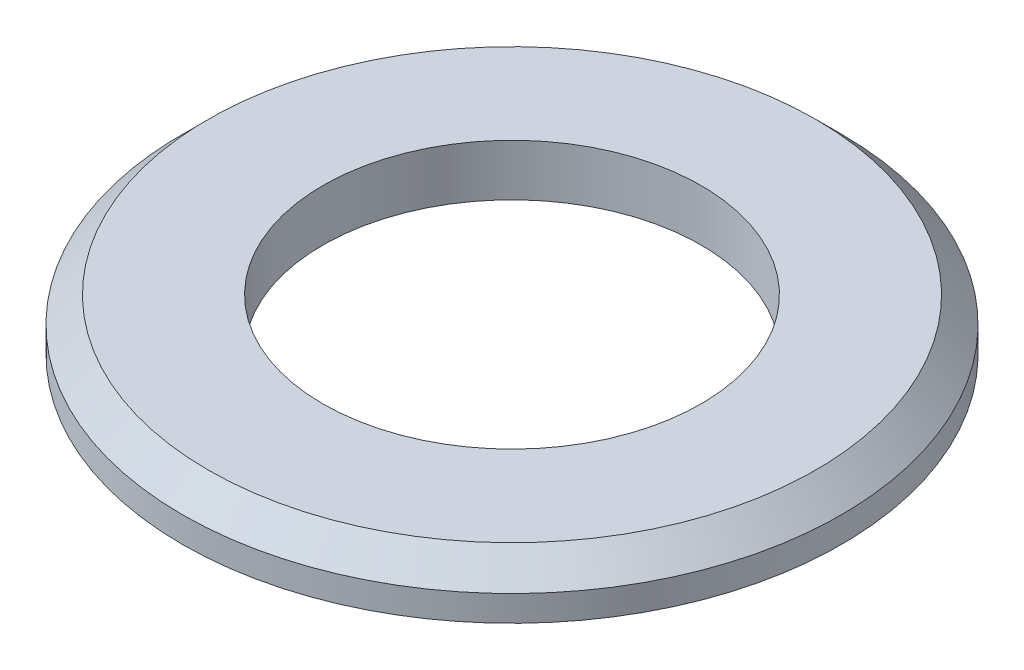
from build123d import *

# Parameters (mm, degrees)
SKETCH1_R      = 57.5
SKETCH1_R_2    = 33
EXTRUDE1_DEPTH = 9
CHAMFER1_SIZE  = 4.5


with BuildPart() as part:
    # Sketch1 → Extrude1 (new body)
    with BuildSketch(Plane(origin=(0, 0, 0), x_dir=(1, 0, 0), z_dir=(0, 1, 0))):
        with Locations(Location((0, 0, 0), (0, 0, 270))):
            Circle(SKETCH1_R)
        with Locations(Location((0, 0, 0), (0, 0, 270))):
            Circle(SKETCH1_R_2, mode=Mode.SUBTRACT)
    extrude(amount=EXTRUDE1_DEPTH)

    # Chamfer1
    chamfer1_edges = [part.edges().sort_by_distance(p)[0] for p in [
        (0, 9, -57.5),
    ]]
    chamfer(chamfer1_edges, length=CHAMFER1_SIZE)


solid = part.part
